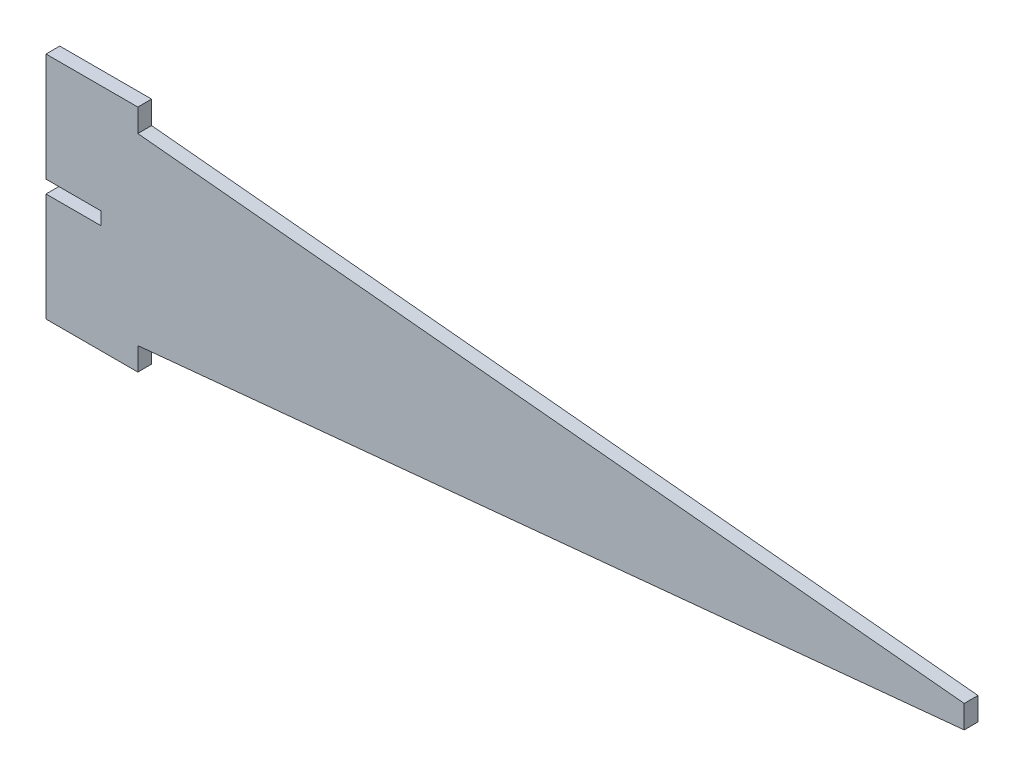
from build123d import *

# Parameters (mm, degrees)
SALIENTE_EXTRUIR1_DEPTH = 3


with BuildPart() as part:
    # Croquis1 → Saliente-Extruir1 (new body)
    with BuildSketch(Plane.XY):
        Polygon((-12, -25), (-12, -1.4), (0, -1.4), (0, 1.4), (-12, 1.4), (-12, 25), (8, 25), (8, 20), (188, 2.5), (188, -2.5), (8, -20), (8, -25), align=None)
    extrude(amount=SALIENTE_EXTRUIR1_DEPTH)


solid = part.part
